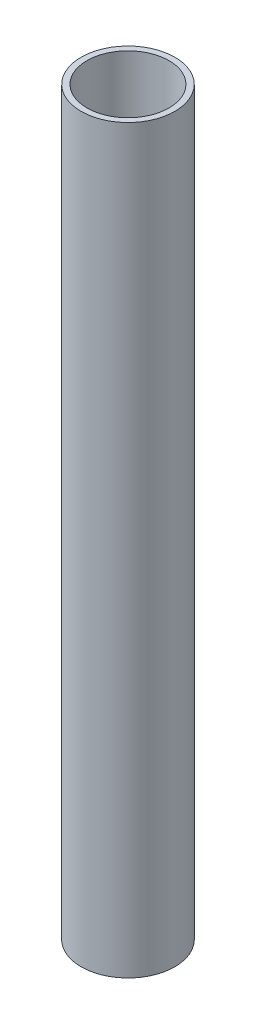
from build123d import *

# Parameters (mm, degrees)
SKETCH1_R           = 6.35
SKETCH1_R_2         = 5.55625
BOSS_EXTRUDE1_DEPTH = 100.33


with BuildPart() as part:
    # Sketch1 → Boss-Extrude1 (new body)
    with BuildSketch(Plane(origin=(0, 0, 0), x_dir=(1, 0, 0), z_dir=(0, 1, 0))):
        with Locations(Location((0, 0, 0), (0, 0, 270))):
            Circle(SKETCH1_R)
        with Locations(Location((0, 0, 0), (0, 0, 270))):
            Circle(SKETCH1_R_2, mode=Mode.SUBTRACT)
    extrude(amount=BOSS_EXTRUDE1_DEPTH)


solid = part.part
